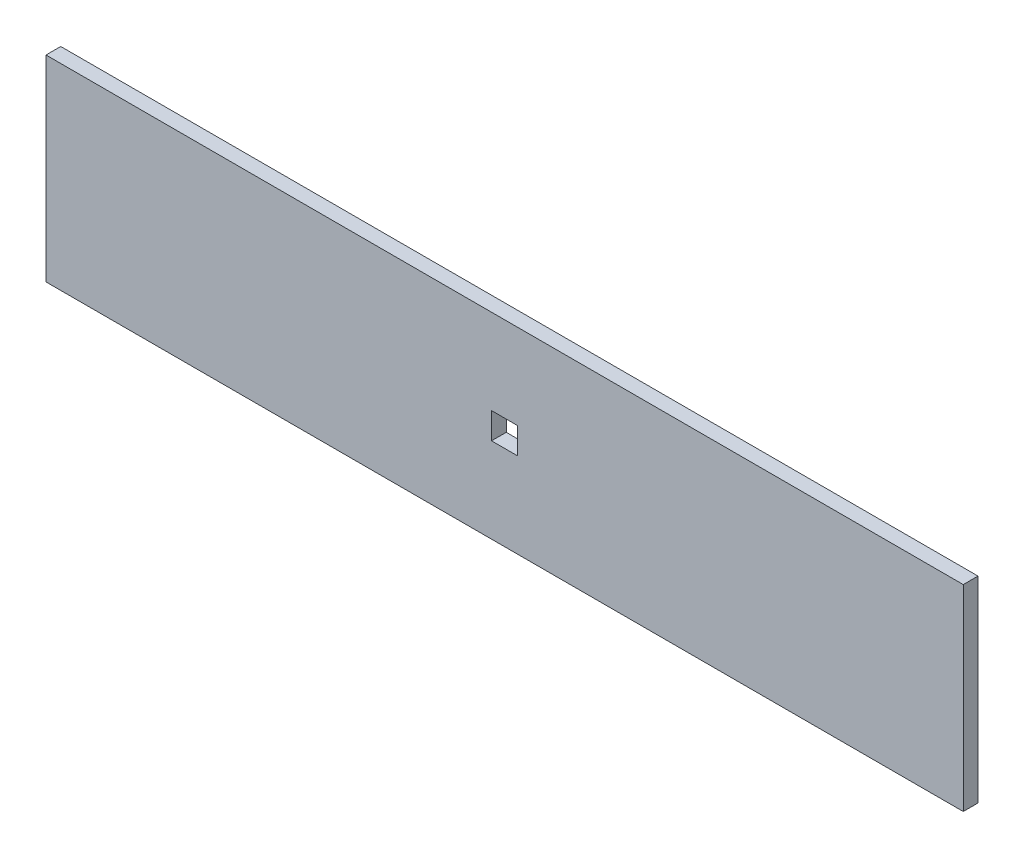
from build123d import *

# Parameters (mm, degrees)
SKETCH1_W           = 280
SKETCH1_H           = 60
BOSS_EXTRUDE1_DEPTH = 4.5
SKETCH2_W           = 8
SKETCH2_H           = 8
CUT_EXTRUDE1_DEPTH  = 144.248909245


with BuildPart() as part:
    # Sketch1 → Boss-Extrude1 (new body)
    with BuildSketch(Plane.XY):
        Rectangle(SKETCH1_W, SKETCH1_H)
    extrude(amount=BOSS_EXTRUDE1_DEPTH)

    # Sketch2 → Cut-Extrude1 (cut, through all)
    with BuildSketch(Plane.XY.offset(4.5)):
        Rectangle(SKETCH2_W, SKETCH2_H)
    extrude(amount=-CUT_EXTRUDE1_DEPTH, mode=Mode.SUBTRACT)


solid = part.part
